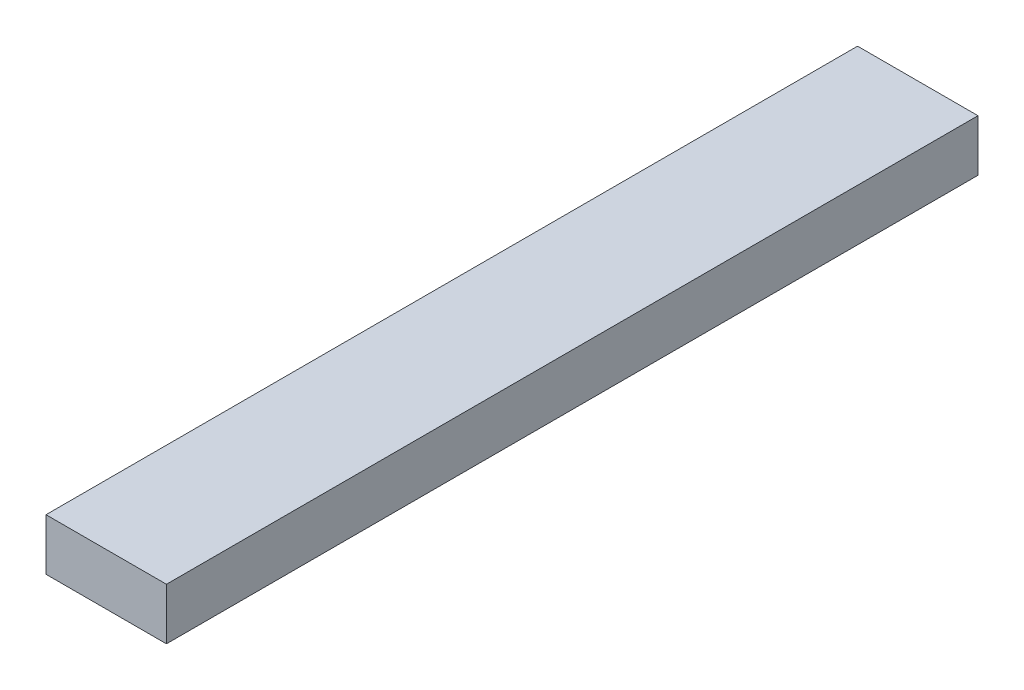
from build123d import *

# Parameters (mm, degrees)
SKETCH1_W           = 42
SKETCH1_H           = 18
BOSS_EXTRUDE1_DEPTH = 283


with BuildPart() as part:
    # Sketch1 → Boss-Extrude1 (new body)
    with BuildSketch(Plane.XY):
        Rectangle(SKETCH1_W, SKETCH1_H)
    extrude(amount=BOSS_EXTRUDE1_DEPTH)


solid = part.part
